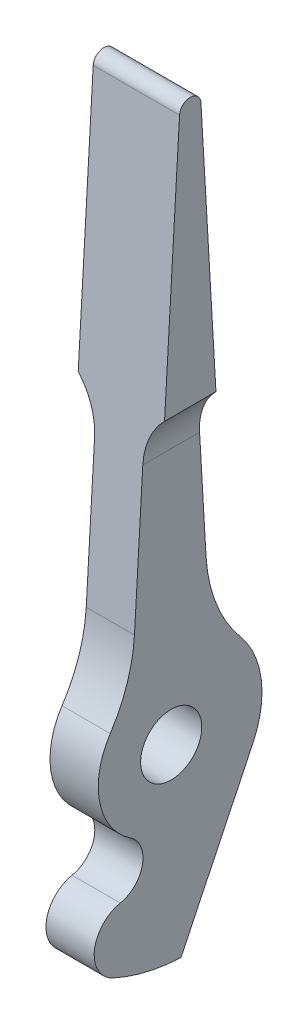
from build123d import *

# Parameters (mm, degrees)
SKETCH_1_R          = 2.60985
EXTRUDE_1_DEPTH     = 3.683
CUT_EXTRUDE_1_DEPTH = 12.573


with BuildPart() as part:
    # Sketch 1 → Extrude 1 (new, symmetric)
    with BuildSketch(Plane(origin=(0, 0, 0), x_dir=(0, 0, -1), z_dir=(1, 0, 0))):
        with BuildLine():
            Line((-3.133242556, 9.65715089), (-0.91285298, 47.779767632))
            ThreePointArc((-0.91285298, 47.779767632), (0, 48.641), (0.91285298, 47.779767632))
            Line((0.91285298, 47.779767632), (2.972356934, 12.419450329))
            ThreePointArc((2.972356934, 12.419450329), (3.850376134, 8.463389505), (5.929832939, 4.985287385))
            ThreePointArc((5.929832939, 4.985287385), (7.686018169, 0.970120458), (6.982597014, -3.355495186))
            Line((6.982597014, -3.355495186), (0.834057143, -16.150261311))
            ThreePointArc((0.834057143, -16.150261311), (-2.125060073, -15.739833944), (-4.950095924, -14.768238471))
            ThreePointArc((-4.950095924, -14.768238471), (-6.551261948, -11.930626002), (-4.343569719, -9.534405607))
            ThreePointArc((-4.343569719, -9.534405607), (-2.450159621, -7.640950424), (-3.470636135, -5.165308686))
            ThreePointArc((-3.470636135, -5.165308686), (-6.100452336, -1.228906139), (-5.199839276, 3.418684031))
            ThreePointArc((-5.199839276, 3.418684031), (-3.756024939, 6.401927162), (-3.133242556, 9.65715089))
        make_face()
        Circle(SKETCH_1_R, mode=Mode.SUBTRACT)
    extrude(amount=EXTRUDE_1_DEPTH, both=True)

    # Sketch 2 → Cut-Extrude 1 (cut, symmetric)
    with BuildSketch(Plane.XY):
        with BuildLine():
            Line((2.0574, -16.150261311), (2.0574, 21.869801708))
            ThreePointArc((2.0574, 21.869801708), (2.479860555, 23.994918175), (3.683, 25.796875))
            Line((3.683, 25.796875), (3.683, -16.150261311))
            Line((3.683, -16.150261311), (2.0574, -16.150261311))
        make_face()
        with BuildLine():
            Line((-3.683, -16.150261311), (-2.0574, -16.150261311))
            Line((-2.0574, -16.150261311), (-2.0574, 21.869801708))
            ThreePointArc((-2.0574, 21.869801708), (-2.479860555, 23.994918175), (-3.683, 25.796875))
            Line((-3.683, 25.796875), (-3.683, -16.150261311))
        make_face()
    extrude(amount=CUT_EXTRUDE_1_DEPTH, both=True, mode=Mode.SUBTRACT)


solid = part.part
